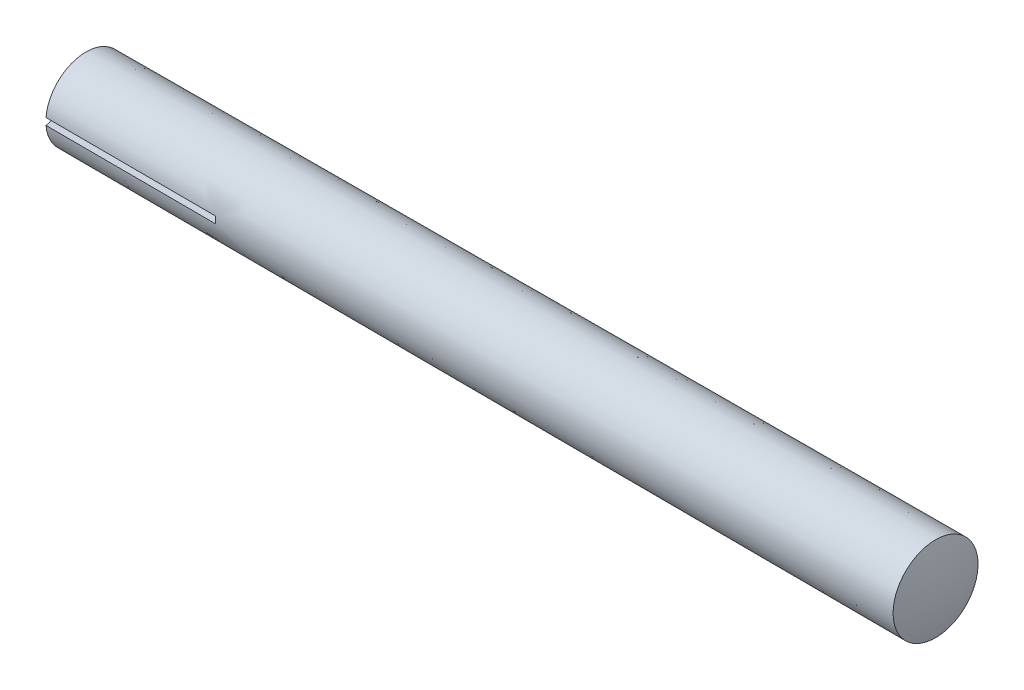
ISO-10303-21;
HEADER;
FILE_DESCRIPTION(('STEP AP214'),'2;1');
FILE_NAME('part.step','',(''),(''),'','','');
FILE_SCHEMA(('AUTOMOTIVE_DESIGN { 1 0 10303 214 1 1 1 1 }'));
ENDSEC;
DATA;
#1=APPLICATION_CONTEXT('core data for automotive mechanical design processes');
#2=APPLICATION_PROTOCOL_DEFINITION('international standard','automotive_design',2000,#1);
#3=PRODUCT_CONTEXT('',#1,'mechanical');
#4=PRODUCT('Part','Part','',(#3));
#5=PRODUCT_RELATED_PRODUCT_CATEGORY('part','',(#4));
#6=PRODUCT_DEFINITION_FORMATION('','',#4);
#7=PRODUCT_DEFINITION_CONTEXT('part definition',#1,'design');
#8=PRODUCT_DEFINITION('design','',#6,#7);
#9=PRODUCT_DEFINITION_SHAPE('','',#8);
#10=(LENGTH_UNIT() NAMED_UNIT(*) SI_UNIT(.MILLI.,.METRE.));
#11=(NAMED_UNIT(*) PLANE_ANGLE_UNIT() SI_UNIT($,.RADIAN.));
#12=(NAMED_UNIT(*) SI_UNIT($,.STERADIAN.) SOLID_ANGLE_UNIT());
#13=UNCERTAINTY_MEASURE_WITH_UNIT(LENGTH_MEASURE(1.E-05),#10,'distance_accuracy_value','');
#14=(GEOMETRIC_REPRESENTATION_CONTEXT(3) GLOBAL_UNCERTAINTY_ASSIGNED_CONTEXT((#13)) GLOBAL_UNIT_ASSIGNED_CONTEXT((#10,
#11,#12)) REPRESENTATION_CONTEXT('',''));
#15=CARTESIAN_POINT('',(0.,0.,0.));
#16=DIRECTION('',(0.,0.,1.));
#17=DIRECTION('',(1.,0.,0.));
#18=AXIS2_PLACEMENT_3D('',#15,#16,#17);
#19=CARTESIAN_POINT('',(12.3382370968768,0.,0.));
#20=DIRECTION('',(-1.,0.,0.));
#21=DIRECTION('',(0.,1.,0.));
#22=AXIS2_PLACEMENT_3D('',#19,#20,#21);
#23=SPHERICAL_SURFACE('',#22,12.7);
#24=CARTESIAN_POINT('',(12.3382370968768,0.253999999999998,0.));
#25=DIRECTION('',(0.,-1.,0.));
#26=DIRECTION('',(0.,0.,-1.));
#27=AXIS2_PLACEMENT_3D('',#24,#25,#26);
#28=CIRCLE('',#27,12.6974597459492);
#29=CARTESIAN_POINT('',(0.,0.253999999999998,2.99889802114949));
#30=VERTEX_POINT('',#29);
#31=CARTESIAN_POINT('',(0.,0.253999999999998,-2.99889802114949));
#32=VERTEX_POINT('',#31);
#33=EDGE_CURVE('E59',#30,#32,#28,.T.);
#34=ORIENTED_EDGE('',*,*,#33,.F.);
#35=CARTESIAN_POINT('',(0.,0.,0.));
#36=DIRECTION('',(-1.,0.,0.));
#37=DIRECTION('',(0.,0.,1.));
#38=AXIS2_PLACEMENT_3D('',#35,#36,#37);
#39=CIRCLE('',#38,3.00963541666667);
#40=EDGE_CURVE('E93',#30,#32,#39,.T.);
#41=ORIENTED_EDGE('',*,*,#40,.T.);
#42=EDGE_LOOP('',(#34,#41));
#43=FACE_BOUND('',#42,.T.);
#44=ADVANCED_FACE('F33',(#43),#23,.T.);
#45=CARTESIAN_POINT('',(12.3382370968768,-0.254000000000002,0.));
#46=DIRECTION('',(0.,1.,0.));
#47=DIRECTION('',(0.,0.,1.));
#48=AXIS2_PLACEMENT_3D('',#45,#46,#47);
#49=CIRCLE('',#48,12.6974597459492);
#50=CARTESIAN_POINT('',(0.,-0.254000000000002,-2.99889802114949));
#51=VERTEX_POINT('',#50);
#52=CARTESIAN_POINT('',(0.,-0.254000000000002,2.99889802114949));
#53=VERTEX_POINT('',#52);
#54=EDGE_CURVE('E133',#51,#53,#49,.T.);
#55=ORIENTED_EDGE('',*,*,#54,.F.);
#56=EDGE_CURVE('E96',#51,#53,#39,.T.);
#57=ORIENTED_EDGE('',*,*,#56,.T.);
#58=EDGE_LOOP('',(#55,#57));
#59=FACE_BOUND('',#58,.T.);
#60=ADVANCED_FACE('F121',(#59),#23,.T.);
#61=CARTESIAN_POINT('',(63.5,0.,0.));
#62=DIRECTION('',(1.,0.,0.));
#63=DIRECTION('',(0.,0.,-1.));
#64=AXIS2_PLACEMENT_3D('',#61,#62,#63);
#65=CONICAL_SURFACE('',#64,3.175,0.00260416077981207);
#66=CARTESIAN_POINT('',(63.5,0.,0.));
#67=DIRECTION('',(-1.,0.,0.));
#68=DIRECTION('',(0.,0.,1.));
#69=AXIS2_PLACEMENT_3D('',#66,#67,#68);
#70=CIRCLE('',#69,3.175);
#71=CARTESIAN_POINT('',(63.5,0.,3.175));
#72=VERTEX_POINT('',#71);
#73=EDGE_CURVE('E95',#72,#72,#70,.T.);
#74=ORIENTED_EDGE('',*,*,#73,.T.);
#75=EDGE_LOOP('',(#74));
#76=FACE_BOUND('',#75,.T.);
#77=CARTESIAN_POINT('',(-5.21560373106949,0.253999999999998,2.9852668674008));
#78=CARTESIAN_POINT('',(-3.2130267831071,0.253999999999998,2.99050075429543));
#79=CARTESIAN_POINT('',(-1.21044983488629,0.253999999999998,2.99573454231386));
#80=CARTESIAN_POINT('',(2.79470406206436,0.253999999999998,3.00620192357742));
#81=CARTESIAN_POINT('',(4.79728101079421,0.253999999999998,3.01143551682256));
#82=CARTESIAN_POINT('',(14.8101657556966,0.253999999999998,3.03760300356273));
#83=CARTESIAN_POINT('',(22.8204735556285,0.253999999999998,3.05853545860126));
#84=CARTESIAN_POINT('',(30.8307813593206,0.253999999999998,3.07946647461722));
#85=B_SPLINE_CURVE_WITH_KNOTS('',3,(#77,#78,#79,#80,#81,#82,#83,#84),.UNSPECIFIED.,.F.,.F.,(4,2,
2,4),(0.,6.00775136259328,12.0155027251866,36.0465081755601),.UNSPECIFIED.);
#86=CARTESIAN_POINT('',(12.7,0.253999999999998,3.03208805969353));
#87=VERTEX_POINT('',#86);
#88=EDGE_CURVE('E11',#87,#30,#85,.F.);
#89=ORIENTED_EDGE('',*,*,#88,.F.);
#90=CARTESIAN_POINT('',(12.7,0.,0.));
#91=DIRECTION('',(1.,0.,0.));
#92=DIRECTION('',(0.,0.,-1.));
#93=AXIS2_PLACEMENT_3D('',#90,#91,#92);
#94=CIRCLE('',#93,3.04270833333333);
#95=CARTESIAN_POINT('',(12.7,-0.254000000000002,3.03208805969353));
#96=VERTEX_POINT('',#95);
#97=EDGE_CURVE('E77',#87,#96,#94,.T.);
#98=ORIENTED_EDGE('',*,*,#97,.T.);
#99=CARTESIAN_POINT('',(-5.21560373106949,-0.254000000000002,2.9852668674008));
#100=CARTESIAN_POINT('',(-3.2130267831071,-0.254000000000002,2.99050075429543));
#101=CARTESIAN_POINT('',(-1.21044983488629,-0.254000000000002,2.99573454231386));
#102=CARTESIAN_POINT('',(2.79470406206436,-0.254000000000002,3.00620192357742));
#103=CARTESIAN_POINT('',(4.79728101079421,-0.254000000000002,3.01143551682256));
#104=CARTESIAN_POINT('',(14.8101657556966,-0.254000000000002,3.03760300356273));
#105=CARTESIAN_POINT('',(22.8204735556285,-0.254000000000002,3.05853545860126));
#106=CARTESIAN_POINT('',(30.8307813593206,-0.254000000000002,3.07946647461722));
#107=B_SPLINE_CURVE_WITH_KNOTS('',3,(#99,#100,#101,#102,#103,#104,#105,#106),.UNSPECIFIED.,.F.,
.F.,(4,2,2,4),(0.,6.00775136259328,12.0155027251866,36.0465081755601),.UNSPECIFIED.);
#108=EDGE_CURVE('E46',#53,#96,#107,.T.);
#109=ORIENTED_EDGE('',*,*,#108,.F.);
#110=ORIENTED_EDGE('',*,*,#56,.F.);
#111=CARTESIAN_POINT('',(-5.21560373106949,-0.254000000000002,-2.9852668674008));
#112=CARTESIAN_POINT('',(-3.2130267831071,-0.254000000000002,-2.99050075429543));
#113=CARTESIAN_POINT('',(-1.21044983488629,-0.254000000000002,-2.99573454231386));
#114=CARTESIAN_POINT('',(2.79470406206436,-0.254000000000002,-3.00620192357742));
#115=CARTESIAN_POINT('',(4.79728101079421,-0.254000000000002,-3.01143551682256));
#116=CARTESIAN_POINT('',(14.8101657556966,-0.254000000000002,-3.03760300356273));
#117=CARTESIAN_POINT('',(22.8204735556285,-0.254000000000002,-3.05853545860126));
#118=CARTESIAN_POINT('',(30.8307813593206,-0.254000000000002,-3.07946647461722));
#119=B_SPLINE_CURVE_WITH_KNOTS('',3,(#111,#112,#113,#114,#115,#116,#117,#118),.UNSPECIFIED.,.F.,
.F.,(4,2,2,4),(0.,6.00775136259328,12.0155027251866,36.0465081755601),.UNSPECIFIED.);
#120=CARTESIAN_POINT('',(12.7,-0.254000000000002,-3.03208805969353));
#121=VERTEX_POINT('',#120);
#122=EDGE_CURVE('E104',#121,#51,#119,.F.);
#123=ORIENTED_EDGE('',*,*,#122,.F.);
#124=CARTESIAN_POINT('',(12.7,0.253999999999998,-3.03208805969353));
#125=VERTEX_POINT('',#124);
#126=EDGE_CURVE('E86',#121,#125,#94,.T.);
#127=ORIENTED_EDGE('',*,*,#126,.T.);
#128=CARTESIAN_POINT('',(-5.21560373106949,0.253999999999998,-2.9852668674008));
#129=CARTESIAN_POINT('',(-3.2130267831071,0.253999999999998,-2.99050075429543));
#130=CARTESIAN_POINT('',(-1.21044983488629,0.253999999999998,-2.99573454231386));
#131=CARTESIAN_POINT('',(2.79470406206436,0.253999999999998,-3.00620192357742));
#132=CARTESIAN_POINT('',(4.79728101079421,0.253999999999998,-3.01143551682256));
#133=CARTESIAN_POINT('',(14.8101657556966,0.253999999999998,-3.03760300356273));
#134=CARTESIAN_POINT('',(22.8204735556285,0.253999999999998,-3.05853545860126));
#135=CARTESIAN_POINT('',(30.8307813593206,0.253999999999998,-3.07946647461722));
#136=B_SPLINE_CURVE_WITH_KNOTS('',3,(#128,#129,#130,#131,#132,#133,#134,#135),.UNSPECIFIED.,.F.,
.F.,(4,2,2,4),(0.,6.00775136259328,12.0155027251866,36.0465081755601),.UNSPECIFIED.);
#137=EDGE_CURVE('E84',#32,#125,#136,.T.);
#138=ORIENTED_EDGE('',*,*,#137,.F.);
#139=ORIENTED_EDGE('',*,*,#40,.F.);
#140=EDGE_LOOP('',(#89,#98,#109,#110,#123,#127,#138,#139));
#141=FACE_BOUND('',#140,.T.);
#142=ADVANCED_FACE('F91',(#76,#141),#65,.T.);
#143=CARTESIAN_POINT('',(51.2032778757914,0.,0.));
#144=DIRECTION('',(-1.,0.,0.));
#145=DIRECTION('',(0.,1.,0.));
#146=AXIS2_PLACEMENT_3D('',#143,#144,#145);
#147=SPHERICAL_SURFACE('',#146,12.7);
#148=ORIENTED_EDGE('',*,*,#73,.F.);
#149=EDGE_LOOP('',(#148));
#150=FACE_BOUND('',#149,.T.);
#151=ADVANCED_FACE('F120',(#150),#147,.T.);
#152=CARTESIAN_POINT('',(25.410155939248,0.253999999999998,-6.35));
#153=DIRECTION('',(0.,-1.,0.));
#154=DIRECTION('',(0.,0.,-1.));
#155=AXIS2_PLACEMENT_3D('',#152,#153,#154);
#156=PLANE('',#155);
#157=ORIENTED_EDGE('',*,*,#137,.T.);
#158=DIRECTION('',(0.,0.,1.));
#159=VECTOR('',#158,1.);
#160=CARTESIAN_POINT('',(12.7,0.253999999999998,-6.35));
#161=LINE('',#160,#159);
#162=EDGE_CURVE('E53',#125,#87,#161,.T.);
#163=ORIENTED_EDGE('',*,*,#162,.T.);
#164=ORIENTED_EDGE('',*,*,#88,.T.);
#165=ORIENTED_EDGE('',*,*,#33,.T.);
#166=EDGE_LOOP('',(#157,#163,#164,#165));
#167=FACE_BOUND('',#166,.T.);
#168=ADVANCED_FACE('F87',(#167),#156,.T.);
#169=CARTESIAN_POINT('',(25.410155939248,-0.254000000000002,-6.35));
#170=DIRECTION('',(0.,1.,0.));
#171=DIRECTION('',(0.,0.,1.));
#172=AXIS2_PLACEMENT_3D('',#169,#170,#171);
#173=PLANE('',#172);
#174=ORIENTED_EDGE('',*,*,#122,.T.);
#175=ORIENTED_EDGE('',*,*,#54,.T.);
#176=ORIENTED_EDGE('',*,*,#108,.T.);
#177=DIRECTION('',(0.,0.,-1.));
#178=VECTOR('',#177,1.);
#179=CARTESIAN_POINT('',(12.7,-0.254000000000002,-6.35));
#180=LINE('',#179,#178);
#181=EDGE_CURVE('E80',#96,#121,#180,.T.);
#182=ORIENTED_EDGE('',*,*,#181,.T.);
#183=EDGE_LOOP('',(#174,#175,#176,#182));
#184=FACE_BOUND('',#183,.T.);
#185=ADVANCED_FACE('F115',(#184),#173,.T.);
#186=CARTESIAN_POINT('',(12.7,0.,0.));
#187=DIRECTION('',(1.,0.,0.));
#188=DIRECTION('',(0.,0.,-1.));
#189=AXIS2_PLACEMENT_3D('',#186,#187,#188);
#190=PLANE('',#189);
#191=ORIENTED_EDGE('',*,*,#162,.F.);
#192=ORIENTED_EDGE('',*,*,#126,.F.);
#193=ORIENTED_EDGE('',*,*,#181,.F.);
#194=ORIENTED_EDGE('',*,*,#97,.F.);
#195=EDGE_LOOP('',(#191,#192,#193,#194));
#196=FACE_BOUND('',#195,.T.);
#197=ADVANCED_FACE('F78',(#196),#190,.F.);
#198=CLOSED_SHELL('',(#44,#60,#142,#151,#168,#185,#197));
#199=MANIFOLD_SOLID_BREP('B2',#198);
#200=ADVANCED_BREP_SHAPE_REPRESENTATION('',(#18,#199),#14);
#201=SHAPE_DEFINITION_REPRESENTATION(#9,#200);
ENDSEC;
END-ISO-10303-21;
